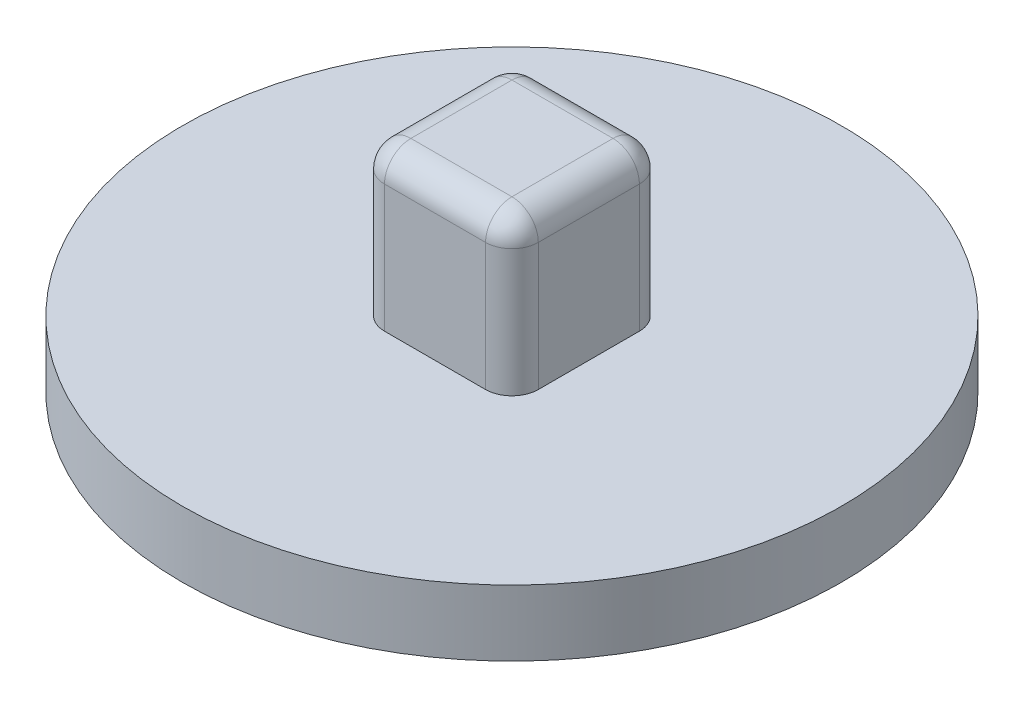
from build123d import *

# Parameters (mm, degrees)
SKETCH1_R           = 75
BOSS_EXTRUDE1_DEPTH = 15
SKETCH24_W          = 35
SKETCH24_H          = 35
BOSS_EXTRUDE2_DEPTH = 35
FILLET1_R           = 6


with BuildPart() as part:
    # Sketch1 → Boss-Extrude1 (new body)
    with BuildSketch(Plane(origin=(0, 0, 0), x_dir=(1, 0, 0), z_dir=(0, 1, 0))):
        with Locations(Location((0, 0, 0), (0, 0, 270))):
            Circle(SKETCH1_R)
    extrude(amount=BOSS_EXTRUDE1_DEPTH)

    # Sketch24 → Boss-Extrude2 (add)
    with BuildSketch(Plane(origin=(-0.488779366, 15, 0.231422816), x_dir=(1, 0, 0), z_dir=(0, 1, 0))):
        with Locations((0.488779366, 0.231422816)):
            Rectangle(SKETCH24_W, SKETCH24_H)
    extrude(amount=BOSS_EXTRUDE2_DEPTH)

    # Fillet1
    fillet1_edges = [part.edges().sort_by_distance(p)[0] for p in [
        (17.5, 32.5, 17.5),
        (17.5, 32.5, -17.5),
        (-17.5, 32.5, -17.5),
        (-17.5, 32.5, 17.5),
        (17.5, 50, 0),
        (0, 50, -17.5),
        (-17.5, 50, 0),
        (0, 50, 17.5),
    ]]
    fillet(fillet1_edges, radius=FILLET1_R)


solid = part.part
